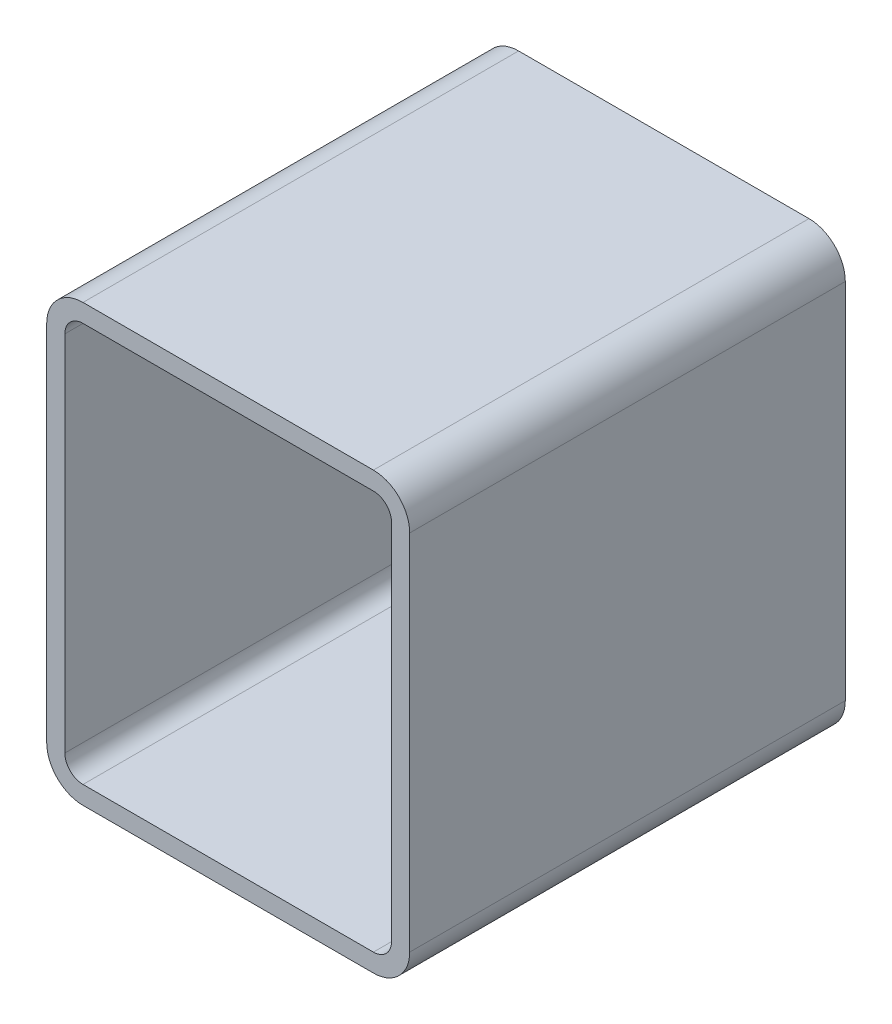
ISO-10303-21;
HEADER;
FILE_DESCRIPTION(('STEP AP214'),'2;1');
FILE_NAME('part.step','',(''),(''),'','','');
FILE_SCHEMA(('AUTOMOTIVE_DESIGN { 1 0 10303 214 1 1 1 1 }'));
ENDSEC;
DATA;
#1=APPLICATION_CONTEXT('core data for automotive mechanical design processes');
#2=APPLICATION_PROTOCOL_DEFINITION('international standard','automotive_design',2000,#1);
#3=PRODUCT_CONTEXT('',#1,'mechanical');
#4=PRODUCT('Part','Part','',(#3));
#5=PRODUCT_RELATED_PRODUCT_CATEGORY('part','',(#4));
#6=PRODUCT_DEFINITION_FORMATION('','',#4);
#7=PRODUCT_DEFINITION_CONTEXT('part definition',#1,'design');
#8=PRODUCT_DEFINITION('design','',#6,#7);
#9=PRODUCT_DEFINITION_SHAPE('','',#8);
#10=(LENGTH_UNIT() NAMED_UNIT(*) SI_UNIT(.MILLI.,.METRE.));
#11=(NAMED_UNIT(*) PLANE_ANGLE_UNIT() SI_UNIT($,.RADIAN.));
#12=(NAMED_UNIT(*) SI_UNIT($,.STERADIAN.) SOLID_ANGLE_UNIT());
#13=UNCERTAINTY_MEASURE_WITH_UNIT(LENGTH_MEASURE(1.E-05),#10,'distance_accuracy_value','');
#14=(GEOMETRIC_REPRESENTATION_CONTEXT(3) GLOBAL_UNCERTAINTY_ASSIGNED_CONTEXT((#13)) GLOBAL_UNIT_ASSIGNED_CONTEXT((#10,
#11,#12)) REPRESENTATION_CONTEXT('',''));
#15=CARTESIAN_POINT('',(0.,0.,0.));
#16=DIRECTION('',(0.,0.,1.));
#17=DIRECTION('',(1.,0.,0.));
#18=AXIS2_PLACEMENT_3D('',#15,#16,#17);
#19=CARTESIAN_POINT('',(28.1345794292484,281.274496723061,304.8));
#20=DIRECTION('',(0.,0.,1.));
#21=DIRECTION('',(1.,0.,0.));
#22=AXIS2_PLACEMENT_3D('',#19,#20,#21);
#23=PLANE('',#22);
#24=CARTESIAN_POINT('',(28.1345794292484,281.274496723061,304.8));
#25=DIRECTION('',(0.,0.,1.));
#26=DIRECTION('',(1.,0.,0.));
#27=AXIS2_PLACEMENT_3D('',#24,#25,#26);
#28=CIRCLE('',#27,25.4);
#29=CARTESIAN_POINT('',(28.1345794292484,306.674496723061,304.8));
#30=VERTEX_POINT('',#29);
#31=CARTESIAN_POINT('',(2.73457942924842,281.274496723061,304.8));
#32=VERTEX_POINT('',#31);
#33=EDGE_CURVE('E211',#30,#32,#28,.T.);
#34=ORIENTED_EDGE('',*,*,#33,.T.);
#35=DIRECTION('',(0.,-1.,0.));
#36=VECTOR('',#35,1.);
#37=CARTESIAN_POINT('',(2.73457942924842,27.2744967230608,304.8));
#38=LINE('',#37,#36);
#39=CARTESIAN_POINT('',(2.73457942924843,27.2744967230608,304.8));
#40=VERTEX_POINT('',#39);
#41=EDGE_CURVE('E214',#32,#40,#38,.T.);
#42=ORIENTED_EDGE('',*,*,#41,.T.);
#43=CARTESIAN_POINT('',(28.1345794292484,27.2744967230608,304.8));
#44=DIRECTION('',(0.,0.,1.));
#45=DIRECTION('',(1.,0.,0.));
#46=AXIS2_PLACEMENT_3D('',#43,#44,#45);
#47=CIRCLE('',#46,25.4);
#48=CARTESIAN_POINT('',(28.1345794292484,1.87449672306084,304.8));
#49=VERTEX_POINT('',#48);
#50=EDGE_CURVE('E217',#40,#49,#47,.T.);
#51=ORIENTED_EDGE('',*,*,#50,.T.);
#52=DIRECTION('',(1.,0.,0.));
#53=VECTOR('',#52,1.);
#54=CARTESIAN_POINT('',(231.334579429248,1.87449672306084,304.8));
#55=LINE('',#54,#53);
#56=CARTESIAN_POINT('',(231.334579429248,1.87449672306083,304.8));
#57=VERTEX_POINT('',#56);
#58=EDGE_CURVE('E219',#49,#57,#55,.T.);
#59=ORIENTED_EDGE('',*,*,#58,.T.);
#60=CARTESIAN_POINT('',(231.334579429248,27.2744967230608,304.8));
#61=DIRECTION('',(0.,0.,1.));
#62=DIRECTION('',(1.,0.,0.));
#63=AXIS2_PLACEMENT_3D('',#60,#61,#62);
#64=CIRCLE('',#63,25.4);
#65=CARTESIAN_POINT('',(256.734579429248,27.2744967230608,304.8));
#66=VERTEX_POINT('',#65);
#67=EDGE_CURVE('E221',#57,#66,#64,.T.);
#68=ORIENTED_EDGE('',*,*,#67,.T.);
#69=DIRECTION('',(0.,1.,0.));
#70=VECTOR('',#69,1.);
#71=CARTESIAN_POINT('',(256.734579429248,281.274496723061,304.8));
#72=LINE('',#71,#70);
#73=CARTESIAN_POINT('',(256.734579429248,281.274496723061,304.8));
#74=VERTEX_POINT('',#73);
#75=EDGE_CURVE('E223',#66,#74,#72,.T.);
#76=ORIENTED_EDGE('',*,*,#75,.T.);
#77=CARTESIAN_POINT('',(231.334579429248,281.274496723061,304.8));
#78=DIRECTION('',(0.,0.,1.));
#79=DIRECTION('',(1.,0.,0.));
#80=AXIS2_PLACEMENT_3D('',#77,#78,#79);
#81=CIRCLE('',#80,25.4);
#82=CARTESIAN_POINT('',(231.334579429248,306.674496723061,304.8));
#83=VERTEX_POINT('',#82);
#84=EDGE_CURVE('E225',#74,#83,#81,.T.);
#85=ORIENTED_EDGE('',*,*,#84,.T.);
#86=DIRECTION('',(-1.,0.,0.));
#87=VECTOR('',#86,1.);
#88=CARTESIAN_POINT('',(28.1345794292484,306.674496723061,304.8));
#89=LINE('',#88,#87);
#90=EDGE_CURVE('E227',#83,#30,#89,.T.);
#91=ORIENTED_EDGE('',*,*,#90,.T.);
#92=EDGE_LOOP('',(#34,#42,#51,#59,#68,#76,#85,#91));
#93=FACE_BOUND('',#92,.T.);
#94=DIRECTION('',(0.,-1.,0.));
#95=VECTOR('',#94,1.);
#96=CARTESIAN_POINT('',(15.4345794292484,27.2744967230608,304.8));
#97=LINE('',#96,#95);
#98=CARTESIAN_POINT('',(15.4345794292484,281.274496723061,304.8));
#99=VERTEX_POINT('',#98);
#100=CARTESIAN_POINT('',(15.4345794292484,27.2744967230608,304.8));
#101=VERTEX_POINT('',#100);
#102=EDGE_CURVE('E154',#99,#101,#97,.T.);
#103=ORIENTED_EDGE('',*,*,#102,.F.);
#104=CARTESIAN_POINT('',(28.1345794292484,281.274496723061,304.8));
#105=DIRECTION('',(0.,0.,1.));
#106=DIRECTION('',(1.,0.,0.));
#107=AXIS2_PLACEMENT_3D('',#104,#105,#106);
#108=CIRCLE('',#107,12.7);
#109=CARTESIAN_POINT('',(28.1345794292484,293.974496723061,304.8));
#110=VERTEX_POINT('',#109);
#111=EDGE_CURVE('E146',#110,#99,#108,.T.);
#112=ORIENTED_EDGE('',*,*,#111,.F.);
#113=DIRECTION('',(-1.,0.,0.));
#114=VECTOR('',#113,1.);
#115=CARTESIAN_POINT('',(28.1345794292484,293.974496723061,304.8));
#116=LINE('',#115,#114);
#117=CARTESIAN_POINT('',(231.334579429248,293.974496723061,304.8));
#118=VERTEX_POINT('',#117);
#119=EDGE_CURVE('E179',#118,#110,#116,.T.);
#120=ORIENTED_EDGE('',*,*,#119,.F.);
#121=CARTESIAN_POINT('',(231.334579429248,281.274496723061,304.8));
#122=DIRECTION('',(0.,0.,1.));
#123=DIRECTION('',(1.,0.,0.));
#124=AXIS2_PLACEMENT_3D('',#121,#122,#123);
#125=CIRCLE('',#124,12.7);
#126=CARTESIAN_POINT('',(244.034579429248,281.274496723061,304.8));
#127=VERTEX_POINT('',#126);
#128=EDGE_CURVE('E177',#127,#118,#125,.T.);
#129=ORIENTED_EDGE('',*,*,#128,.F.);
#130=DIRECTION('',(0.,1.,0.));
#131=VECTOR('',#130,1.);
#132=CARTESIAN_POINT('',(244.034579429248,281.274496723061,304.8));
#133=LINE('',#132,#131);
#134=CARTESIAN_POINT('',(244.034579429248,27.2744967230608,304.8));
#135=VERTEX_POINT('',#134);
#136=EDGE_CURVE('E175',#135,#127,#133,.T.);
#137=ORIENTED_EDGE('',*,*,#136,.F.);
#138=CARTESIAN_POINT('',(231.334579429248,27.2744967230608,304.8));
#139=DIRECTION('',(0.,0.,1.));
#140=DIRECTION('',(1.,0.,0.));
#141=AXIS2_PLACEMENT_3D('',#138,#139,#140);
#142=CIRCLE('',#141,12.7);
#143=CARTESIAN_POINT('',(231.334579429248,14.5744967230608,304.8));
#144=VERTEX_POINT('',#143);
#145=EDGE_CURVE('E173',#144,#135,#142,.T.);
#146=ORIENTED_EDGE('',*,*,#145,.F.);
#147=DIRECTION('',(1.,0.,0.));
#148=VECTOR('',#147,1.);
#149=CARTESIAN_POINT('',(231.334579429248,14.5744967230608,304.8));
#150=LINE('',#149,#148);
#151=CARTESIAN_POINT('',(28.1345794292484,14.5744967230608,304.8));
#152=VERTEX_POINT('',#151);
#153=EDGE_CURVE('E169',#152,#144,#150,.T.);
#154=ORIENTED_EDGE('',*,*,#153,.F.);
#155=CARTESIAN_POINT('',(28.1345794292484,27.2744967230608,304.8));
#156=DIRECTION('',(0.,0.,1.));
#157=DIRECTION('',(1.,0.,0.));
#158=AXIS2_PLACEMENT_3D('',#155,#156,#157);
#159=CIRCLE('',#158,12.7);
#160=EDGE_CURVE('E167',#101,#152,#159,.T.);
#161=ORIENTED_EDGE('',*,*,#160,.F.);
#162=EDGE_LOOP('',(#103,#112,#120,#129,#137,#146,#154,#161));
#163=FACE_BOUND('',#162,.T.);
#164=ADVANCED_FACE('F33',(#93,#163),#23,.T.);
#165=CARTESIAN_POINT('',(28.1345794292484,281.274496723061,0.));
#166=DIRECTION('',(0.,0.,1.));
#167=DIRECTION('',(1.,0.,0.));
#168=AXIS2_PLACEMENT_3D('',#165,#166,#167);
#169=PLANE('',#168);
#170=CARTESIAN_POINT('',(28.1345794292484,281.274496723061,0.));
#171=DIRECTION('',(0.,0.,1.));
#172=DIRECTION('',(1.,0.,0.));
#173=AXIS2_PLACEMENT_3D('',#170,#171,#172);
#174=CIRCLE('',#173,25.4);
#175=CARTESIAN_POINT('',(28.1345794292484,306.674496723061,0.));
#176=VERTEX_POINT('',#175);
#177=CARTESIAN_POINT('',(2.73457942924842,281.274496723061,0.));
#178=VERTEX_POINT('',#177);
#179=EDGE_CURVE('E162',#176,#178,#174,.T.);
#180=ORIENTED_EDGE('',*,*,#179,.F.);
#181=DIRECTION('',(-1.,0.,0.));
#182=VECTOR('',#181,1.);
#183=CARTESIAN_POINT('',(28.1345794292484,306.674496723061,0.));
#184=LINE('',#183,#182);
#185=CARTESIAN_POINT('',(231.334579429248,306.674496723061,0.));
#186=VERTEX_POINT('',#185);
#187=EDGE_CURVE('E215',#186,#176,#184,.T.);
#188=ORIENTED_EDGE('',*,*,#187,.F.);
#189=CARTESIAN_POINT('',(231.334579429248,281.274496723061,0.));
#190=DIRECTION('',(0.,0.,1.));
#191=DIRECTION('',(1.,0.,0.));
#192=AXIS2_PLACEMENT_3D('',#189,#190,#191);
#193=CIRCLE('',#192,25.4);
#194=CARTESIAN_POINT('',(256.734579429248,281.274496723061,0.));
#195=VERTEX_POINT('',#194);
#196=EDGE_CURVE('E242',#195,#186,#193,.T.);
#197=ORIENTED_EDGE('',*,*,#196,.F.);
#198=DIRECTION('',(0.,1.,0.));
#199=VECTOR('',#198,1.);
#200=CARTESIAN_POINT('',(256.734579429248,281.274496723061,0.));
#201=LINE('',#200,#199);
#202=CARTESIAN_POINT('',(256.734579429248,27.2744967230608,0.));
#203=VERTEX_POINT('',#202);
#204=EDGE_CURVE('E240',#203,#195,#201,.T.);
#205=ORIENTED_EDGE('',*,*,#204,.F.);
#206=CARTESIAN_POINT('',(231.334579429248,27.2744967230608,0.));
#207=DIRECTION('',(0.,0.,1.));
#208=DIRECTION('',(1.,0.,0.));
#209=AXIS2_PLACEMENT_3D('',#206,#207,#208);
#210=CIRCLE('',#209,25.4);
#211=CARTESIAN_POINT('',(231.334579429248,1.87449672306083,0.));
#212=VERTEX_POINT('',#211);
#213=EDGE_CURVE('E238',#212,#203,#210,.T.);
#214=ORIENTED_EDGE('',*,*,#213,.F.);
#215=DIRECTION('',(1.,0.,0.));
#216=VECTOR('',#215,1.);
#217=CARTESIAN_POINT('',(231.334579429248,1.87449672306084,0.));
#218=LINE('',#217,#216);
#219=CARTESIAN_POINT('',(28.1345794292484,1.87449672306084,0.));
#220=VERTEX_POINT('',#219);
#221=EDGE_CURVE('E236',#220,#212,#218,.T.);
#222=ORIENTED_EDGE('',*,*,#221,.F.);
#223=CARTESIAN_POINT('',(28.1345794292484,27.2744967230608,0.));
#224=DIRECTION('',(0.,0.,1.));
#225=DIRECTION('',(1.,0.,0.));
#226=AXIS2_PLACEMENT_3D('',#223,#224,#225);
#227=CIRCLE('',#226,25.4);
#228=CARTESIAN_POINT('',(2.73457942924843,27.2744967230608,0.));
#229=VERTEX_POINT('',#228);
#230=EDGE_CURVE('E234',#229,#220,#227,.T.);
#231=ORIENTED_EDGE('',*,*,#230,.F.);
#232=DIRECTION('',(0.,-1.,0.));
#233=VECTOR('',#232,1.);
#234=CARTESIAN_POINT('',(2.73457942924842,27.2744967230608,0.));
#235=LINE('',#234,#233);
#236=EDGE_CURVE('E232',#178,#229,#235,.T.);
#237=ORIENTED_EDGE('',*,*,#236,.F.);
#238=EDGE_LOOP('',(#180,#188,#197,#205,#214,#222,#231,#237));
#239=FACE_BOUND('',#238,.T.);
#240=CARTESIAN_POINT('',(28.1345794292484,281.274496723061,0.));
#241=DIRECTION('',(0.,0.,1.));
#242=DIRECTION('',(1.,0.,0.));
#243=AXIS2_PLACEMENT_3D('',#240,#241,#242);
#244=CIRCLE('',#243,12.7);
#245=CARTESIAN_POINT('',(28.1345794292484,293.974496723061,0.));
#246=VERTEX_POINT('',#245);
#247=CARTESIAN_POINT('',(15.4345794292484,281.274496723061,0.));
#248=VERTEX_POINT('',#247);
#249=EDGE_CURVE('E56',#246,#248,#244,.T.);
#250=ORIENTED_EDGE('',*,*,#249,.T.);
#251=DIRECTION('',(0.,-1.,0.));
#252=VECTOR('',#251,1.);
#253=CARTESIAN_POINT('',(15.4345794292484,27.2744967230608,0.));
#254=LINE('',#253,#252);
#255=CARTESIAN_POINT('',(15.4345794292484,27.2744967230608,0.));
#256=VERTEX_POINT('',#255);
#257=EDGE_CURVE('E161',#248,#256,#254,.T.);
#258=ORIENTED_EDGE('',*,*,#257,.T.);
#259=CARTESIAN_POINT('',(28.1345794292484,27.2744967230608,0.));
#260=DIRECTION('',(0.,0.,1.));
#261=DIRECTION('',(1.,0.,0.));
#262=AXIS2_PLACEMENT_3D('',#259,#260,#261);
#263=CIRCLE('',#262,12.7);
#264=CARTESIAN_POINT('',(28.1345794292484,14.5744967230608,0.));
#265=VERTEX_POINT('',#264);
#266=EDGE_CURVE('E183',#256,#265,#263,.T.);
#267=ORIENTED_EDGE('',*,*,#266,.T.);
#268=DIRECTION('',(1.,0.,0.));
#269=VECTOR('',#268,1.);
#270=CARTESIAN_POINT('',(231.334579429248,14.5744967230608,0.));
#271=LINE('',#270,#269);
#272=CARTESIAN_POINT('',(231.334579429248,14.5744967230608,0.));
#273=VERTEX_POINT('',#272);
#274=EDGE_CURVE('E186',#265,#273,#271,.T.);
#275=ORIENTED_EDGE('',*,*,#274,.T.);
#276=CARTESIAN_POINT('',(231.334579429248,27.2744967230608,0.));
#277=DIRECTION('',(0.,0.,1.));
#278=DIRECTION('',(1.,0.,0.));
#279=AXIS2_PLACEMENT_3D('',#276,#277,#278);
#280=CIRCLE('',#279,12.7);
#281=CARTESIAN_POINT('',(244.034579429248,27.2744967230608,0.));
#282=VERTEX_POINT('',#281);
#283=EDGE_CURVE('E189',#273,#282,#280,.T.);
#284=ORIENTED_EDGE('',*,*,#283,.T.);
#285=DIRECTION('',(0.,1.,0.));
#286=VECTOR('',#285,1.);
#287=CARTESIAN_POINT('',(244.034579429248,281.274496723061,0.));
#288=LINE('',#287,#286);
#289=CARTESIAN_POINT('',(244.034579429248,281.274496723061,0.));
#290=VERTEX_POINT('',#289);
#291=EDGE_CURVE('E192',#282,#290,#288,.T.);
#292=ORIENTED_EDGE('',*,*,#291,.T.);
#293=CARTESIAN_POINT('',(231.334579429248,281.274496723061,0.));
#294=DIRECTION('',(0.,0.,1.));
#295=DIRECTION('',(1.,0.,0.));
#296=AXIS2_PLACEMENT_3D('',#293,#294,#295);
#297=CIRCLE('',#296,12.7);
#298=CARTESIAN_POINT('',(231.334579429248,293.974496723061,0.));
#299=VERTEX_POINT('',#298);
#300=EDGE_CURVE('E195',#290,#299,#297,.T.);
#301=ORIENTED_EDGE('',*,*,#300,.T.);
#302=DIRECTION('',(-1.,0.,0.));
#303=VECTOR('',#302,1.);
#304=CARTESIAN_POINT('',(28.1345794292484,293.974496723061,0.));
#305=LINE('',#304,#303);
#306=EDGE_CURVE('E155',#299,#246,#305,.T.);
#307=ORIENTED_EDGE('',*,*,#306,.T.);
#308=EDGE_LOOP('',(#250,#258,#267,#275,#284,#292,#301,#307));
#309=FACE_BOUND('',#308,.T.);
#310=ADVANCED_FACE('F272',(#239,#309),#169,.F.);
#311=CARTESIAN_POINT('',(28.1345794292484,281.274496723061,304.8));
#312=DIRECTION('',(0.,0.,-1.));
#313=DIRECTION('',(-1.,0.,0.));
#314=AXIS2_PLACEMENT_3D('',#311,#312,#313);
#315=CYLINDRICAL_SURFACE('',#314,25.4);
#316=ORIENTED_EDGE('',*,*,#179,.T.);
#317=DIRECTION('',(0.,0.,-1.));
#318=VECTOR('',#317,1.);
#319=CARTESIAN_POINT('',(2.73457942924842,281.274496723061,304.8));
#320=LINE('',#319,#318);
#321=EDGE_CURVE('E11',#32,#178,#320,.T.);
#322=ORIENTED_EDGE('',*,*,#321,.F.);
#323=ORIENTED_EDGE('',*,*,#33,.F.);
#324=DIRECTION('',(0.,0.,-1.));
#325=VECTOR('',#324,1.);
#326=CARTESIAN_POINT('',(28.1345794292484,306.674496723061,304.8));
#327=LINE('',#326,#325);
#328=EDGE_CURVE('E229',#30,#176,#327,.T.);
#329=ORIENTED_EDGE('',*,*,#328,.T.);
#330=EDGE_LOOP('',(#316,#322,#323,#329));
#331=FACE_BOUND('',#330,.T.);
#332=ADVANCED_FACE('F35',(#331),#315,.T.);
#333=CARTESIAN_POINT('',(2.73457942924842,27.2744967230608,304.8));
#334=DIRECTION('',(1.,0.,0.));
#335=DIRECTION('',(0.,0.,-1.));
#336=AXIS2_PLACEMENT_3D('',#333,#334,#335);
#337=PLANE('',#336);
#338=ORIENTED_EDGE('',*,*,#236,.T.);
#339=DIRECTION('',(0.,0.,-1.));
#340=VECTOR('',#339,1.);
#341=CARTESIAN_POINT('',(2.73457942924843,27.2744967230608,304.8));
#342=LINE('',#341,#340);
#343=EDGE_CURVE('E41',#40,#229,#342,.T.);
#344=ORIENTED_EDGE('',*,*,#343,.F.);
#345=ORIENTED_EDGE('',*,*,#41,.F.);
#346=ORIENTED_EDGE('',*,*,#321,.T.);
#347=EDGE_LOOP('',(#338,#344,#345,#346));
#348=FACE_BOUND('',#347,.T.);
#349=ADVANCED_FACE('F289',(#348),#337,.F.);
#350=CARTESIAN_POINT('',(28.1345794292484,27.2744967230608,304.8));
#351=DIRECTION('',(0.,0.,-1.));
#352=DIRECTION('',(-1.,0.,0.));
#353=AXIS2_PLACEMENT_3D('',#350,#351,#352);
#354=CYLINDRICAL_SURFACE('',#353,25.4);
#355=ORIENTED_EDGE('',*,*,#230,.T.);
#356=DIRECTION('',(0.,0.,-1.));
#357=VECTOR('',#356,1.);
#358=CARTESIAN_POINT('',(28.1345794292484,1.87449672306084,304.8));
#359=LINE('',#358,#357);
#360=EDGE_CURVE('E259',#49,#220,#359,.T.);
#361=ORIENTED_EDGE('',*,*,#360,.F.);
#362=ORIENTED_EDGE('',*,*,#50,.F.);
#363=ORIENTED_EDGE('',*,*,#343,.T.);
#364=EDGE_LOOP('',(#355,#361,#362,#363));
#365=FACE_BOUND('',#364,.T.);
#366=ADVANCED_FACE('F266',(#365),#354,.T.);
#367=CARTESIAN_POINT('',(231.334579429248,1.87449672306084,304.8));
#368=DIRECTION('',(0.,1.,0.));
#369=DIRECTION('',(0.,0.,1.));
#370=AXIS2_PLACEMENT_3D('',#367,#368,#369);
#371=PLANE('',#370);
#372=ORIENTED_EDGE('',*,*,#221,.T.);
#373=DIRECTION('',(0.,0.,-1.));
#374=VECTOR('',#373,1.);
#375=CARTESIAN_POINT('',(231.334579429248,1.87449672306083,304.8));
#376=LINE('',#375,#374);
#377=EDGE_CURVE('E256',#57,#212,#376,.T.);
#378=ORIENTED_EDGE('',*,*,#377,.F.);
#379=ORIENTED_EDGE('',*,*,#58,.F.);
#380=ORIENTED_EDGE('',*,*,#360,.T.);
#381=EDGE_LOOP('',(#372,#378,#379,#380));
#382=FACE_BOUND('',#381,.T.);
#383=ADVANCED_FACE('F278',(#382),#371,.F.);
#384=CARTESIAN_POINT('',(231.334579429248,27.2744967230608,304.8));
#385=DIRECTION('',(0.,0.,-1.));
#386=DIRECTION('',(-1.,0.,0.));
#387=AXIS2_PLACEMENT_3D('',#384,#385,#386);
#388=CYLINDRICAL_SURFACE('',#387,25.4);
#389=ORIENTED_EDGE('',*,*,#213,.T.);
#390=DIRECTION('',(0.,0.,-1.));
#391=VECTOR('',#390,1.);
#392=CARTESIAN_POINT('',(256.734579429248,27.2744967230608,304.8));
#393=LINE('',#392,#391);
#394=EDGE_CURVE('E253',#66,#203,#393,.T.);
#395=ORIENTED_EDGE('',*,*,#394,.F.);
#396=ORIENTED_EDGE('',*,*,#67,.F.);
#397=ORIENTED_EDGE('',*,*,#377,.T.);
#398=EDGE_LOOP('',(#389,#395,#396,#397));
#399=FACE_BOUND('',#398,.T.);
#400=ADVANCED_FACE('F282',(#399),#388,.T.);
#401=CARTESIAN_POINT('',(256.734579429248,281.274496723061,304.8));
#402=DIRECTION('',(-1.,0.,0.));
#403=DIRECTION('',(0.,0.,1.));
#404=AXIS2_PLACEMENT_3D('',#401,#402,#403);
#405=PLANE('',#404);
#406=ORIENTED_EDGE('',*,*,#204,.T.);
#407=DIRECTION('',(0.,0.,-1.));
#408=VECTOR('',#407,1.);
#409=CARTESIAN_POINT('',(256.734579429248,281.274496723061,304.8));
#410=LINE('',#409,#408);
#411=EDGE_CURVE('E250',#74,#195,#410,.T.);
#412=ORIENTED_EDGE('',*,*,#411,.F.);
#413=ORIENTED_EDGE('',*,*,#75,.F.);
#414=ORIENTED_EDGE('',*,*,#394,.T.);
#415=EDGE_LOOP('',(#406,#412,#413,#414));
#416=FACE_BOUND('',#415,.T.);
#417=ADVANCED_FACE('F302',(#416),#405,.F.);
#418=CARTESIAN_POINT('',(231.334579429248,281.274496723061,304.8));
#419=DIRECTION('',(0.,0.,-1.));
#420=DIRECTION('',(-1.,0.,0.));
#421=AXIS2_PLACEMENT_3D('',#418,#419,#420);
#422=CYLINDRICAL_SURFACE('',#421,25.4);
#423=ORIENTED_EDGE('',*,*,#196,.T.);
#424=DIRECTION('',(0.,0.,-1.));
#425=VECTOR('',#424,1.);
#426=CARTESIAN_POINT('',(231.334579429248,306.674496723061,304.8));
#427=LINE('',#426,#425);
#428=EDGE_CURVE('E247',#83,#186,#427,.T.);
#429=ORIENTED_EDGE('',*,*,#428,.F.);
#430=ORIENTED_EDGE('',*,*,#84,.F.);
#431=ORIENTED_EDGE('',*,*,#411,.T.);
#432=EDGE_LOOP('',(#423,#429,#430,#431));
#433=FACE_BOUND('',#432,.T.);
#434=ADVANCED_FACE('F300',(#433),#422,.T.);
#435=CARTESIAN_POINT('',(28.1345794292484,306.674496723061,304.8));
#436=DIRECTION('',(0.,-1.,0.));
#437=DIRECTION('',(0.,0.,-1.));
#438=AXIS2_PLACEMENT_3D('',#435,#436,#437);
#439=PLANE('',#438);
#440=ORIENTED_EDGE('',*,*,#187,.T.);
#441=ORIENTED_EDGE('',*,*,#328,.F.);
#442=ORIENTED_EDGE('',*,*,#90,.F.);
#443=ORIENTED_EDGE('',*,*,#428,.T.);
#444=EDGE_LOOP('',(#440,#441,#442,#443));
#445=FACE_BOUND('',#444,.T.);
#446=ADVANCED_FACE('F295',(#445),#439,.F.);
#447=CARTESIAN_POINT('',(28.1345794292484,281.274496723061,304.8));
#448=DIRECTION('',(0.,0.,-1.));
#449=DIRECTION('',(-1.,0.,0.));
#450=AXIS2_PLACEMENT_3D('',#447,#448,#449);
#451=CYLINDRICAL_SURFACE('',#450,12.7);
#452=ORIENTED_EDGE('',*,*,#249,.F.);
#453=DIRECTION('',(0.,0.,-1.));
#454=VECTOR('',#453,1.);
#455=CARTESIAN_POINT('',(28.1345794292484,293.974496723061,304.8));
#456=LINE('',#455,#454);
#457=EDGE_CURVE('E150',#110,#246,#456,.T.);
#458=ORIENTED_EDGE('',*,*,#457,.F.);
#459=ORIENTED_EDGE('',*,*,#111,.T.);
#460=DIRECTION('',(0.,0.,-1.));
#461=VECTOR('',#460,1.);
#462=CARTESIAN_POINT('',(15.4345794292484,281.274496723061,304.8));
#463=LINE('',#462,#461);
#464=EDGE_CURVE('E149',#99,#248,#463,.T.);
#465=ORIENTED_EDGE('',*,*,#464,.T.);
#466=EDGE_LOOP('',(#452,#458,#459,#465));
#467=FACE_BOUND('',#466,.T.);
#468=ADVANCED_FACE('F148',(#467),#451,.F.);
#469=CARTESIAN_POINT('',(15.4345794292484,27.2744967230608,304.8));
#470=DIRECTION('',(1.,0.,0.));
#471=DIRECTION('',(0.,0.,-1.));
#472=AXIS2_PLACEMENT_3D('',#469,#470,#471);
#473=PLANE('',#472);
#474=ORIENTED_EDGE('',*,*,#257,.F.);
#475=ORIENTED_EDGE('',*,*,#464,.F.);
#476=ORIENTED_EDGE('',*,*,#102,.T.);
#477=DIRECTION('',(0.,0.,-1.));
#478=VECTOR('',#477,1.);
#479=CARTESIAN_POINT('',(15.4345794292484,27.2744967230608,304.8));
#480=LINE('',#479,#478);
#481=EDGE_CURVE('E163',#101,#256,#480,.T.);
#482=ORIENTED_EDGE('',*,*,#481,.T.);
#483=EDGE_LOOP('',(#474,#475,#476,#482));
#484=FACE_BOUND('',#483,.T.);
#485=ADVANCED_FACE('F158',(#484),#473,.T.);
#486=CARTESIAN_POINT('',(28.1345794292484,27.2744967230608,304.8));
#487=DIRECTION('',(0.,0.,-1.));
#488=DIRECTION('',(-1.,0.,0.));
#489=AXIS2_PLACEMENT_3D('',#486,#487,#488);
#490=CYLINDRICAL_SURFACE('',#489,12.7);
#491=ORIENTED_EDGE('',*,*,#266,.F.);
#492=ORIENTED_EDGE('',*,*,#481,.F.);
#493=ORIENTED_EDGE('',*,*,#160,.T.);
#494=DIRECTION('',(0.,0.,-1.));
#495=VECTOR('',#494,1.);
#496=CARTESIAN_POINT('',(28.1345794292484,14.5744967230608,304.8));
#497=LINE('',#496,#495);
#498=EDGE_CURVE('E208',#152,#265,#497,.T.);
#499=ORIENTED_EDGE('',*,*,#498,.T.);
#500=EDGE_LOOP('',(#491,#492,#493,#499));
#501=FACE_BOUND('',#500,.T.);
#502=ADVANCED_FACE('F327',(#501),#490,.F.);
#503=CARTESIAN_POINT('',(231.334579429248,14.5744967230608,304.8));
#504=DIRECTION('',(0.,1.,0.));
#505=DIRECTION('',(0.,0.,1.));
#506=AXIS2_PLACEMENT_3D('',#503,#504,#505);
#507=PLANE('',#506);
#508=ORIENTED_EDGE('',*,*,#274,.F.);
#509=ORIENTED_EDGE('',*,*,#498,.F.);
#510=ORIENTED_EDGE('',*,*,#153,.T.);
#511=DIRECTION('',(0.,0.,-1.));
#512=VECTOR('',#511,1.);
#513=CARTESIAN_POINT('',(231.334579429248,14.5744967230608,304.8));
#514=LINE('',#513,#512);
#515=EDGE_CURVE('E206',#144,#273,#514,.T.);
#516=ORIENTED_EDGE('',*,*,#515,.T.);
#517=EDGE_LOOP('',(#508,#509,#510,#516));
#518=FACE_BOUND('',#517,.T.);
#519=ADVANCED_FACE('F331',(#518),#507,.T.);
#520=CARTESIAN_POINT('',(231.334579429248,27.2744967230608,304.8));
#521=DIRECTION('',(0.,0.,-1.));
#522=DIRECTION('',(-1.,0.,0.));
#523=AXIS2_PLACEMENT_3D('',#520,#521,#522);
#524=CYLINDRICAL_SURFACE('',#523,12.7);
#525=ORIENTED_EDGE('',*,*,#283,.F.);
#526=ORIENTED_EDGE('',*,*,#515,.F.);
#527=ORIENTED_EDGE('',*,*,#145,.T.);
#528=DIRECTION('',(0.,0.,-1.));
#529=VECTOR('',#528,1.);
#530=CARTESIAN_POINT('',(244.034579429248,27.2744967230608,304.8));
#531=LINE('',#530,#529);
#532=EDGE_CURVE('E204',#135,#282,#531,.T.);
#533=ORIENTED_EDGE('',*,*,#532,.T.);
#534=EDGE_LOOP('',(#525,#526,#527,#533));
#535=FACE_BOUND('',#534,.T.);
#536=ADVANCED_FACE('F337',(#535),#524,.F.);
#537=CARTESIAN_POINT('',(244.034579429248,281.274496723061,304.8));
#538=DIRECTION('',(-1.,0.,0.));
#539=DIRECTION('',(0.,0.,1.));
#540=AXIS2_PLACEMENT_3D('',#537,#538,#539);
#541=PLANE('',#540);
#542=ORIENTED_EDGE('',*,*,#291,.F.);
#543=ORIENTED_EDGE('',*,*,#532,.F.);
#544=ORIENTED_EDGE('',*,*,#136,.T.);
#545=DIRECTION('',(0.,0.,-1.));
#546=VECTOR('',#545,1.);
#547=CARTESIAN_POINT('',(244.034579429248,281.274496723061,304.8));
#548=LINE('',#547,#546);
#549=EDGE_CURVE('E202',#127,#290,#548,.T.);
#550=ORIENTED_EDGE('',*,*,#549,.T.);
#551=EDGE_LOOP('',(#542,#543,#544,#550));
#552=FACE_BOUND('',#551,.T.);
#553=ADVANCED_FACE('F341',(#552),#541,.T.);
#554=CARTESIAN_POINT('',(231.334579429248,281.274496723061,304.8));
#555=DIRECTION('',(0.,0.,-1.));
#556=DIRECTION('',(-1.,0.,0.));
#557=AXIS2_PLACEMENT_3D('',#554,#555,#556);
#558=CYLINDRICAL_SURFACE('',#557,12.7);
#559=ORIENTED_EDGE('',*,*,#300,.F.);
#560=ORIENTED_EDGE('',*,*,#549,.F.);
#561=ORIENTED_EDGE('',*,*,#128,.T.);
#562=DIRECTION('',(0.,0.,-1.));
#563=VECTOR('',#562,1.);
#564=CARTESIAN_POINT('',(231.334579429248,293.974496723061,304.8));
#565=LINE('',#564,#563);
#566=EDGE_CURVE('E48',#118,#299,#565,.T.);
#567=ORIENTED_EDGE('',*,*,#566,.T.);
#568=EDGE_LOOP('',(#559,#560,#561,#567));
#569=FACE_BOUND('',#568,.T.);
#570=ADVANCED_FACE('F345',(#569),#558,.F.);
#571=CARTESIAN_POINT('',(28.1345794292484,293.974496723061,304.8));
#572=DIRECTION('',(0.,-1.,0.));
#573=DIRECTION('',(0.,0.,-1.));
#574=AXIS2_PLACEMENT_3D('',#571,#572,#573);
#575=PLANE('',#574);
#576=ORIENTED_EDGE('',*,*,#306,.F.);
#577=ORIENTED_EDGE('',*,*,#566,.F.);
#578=ORIENTED_EDGE('',*,*,#119,.T.);
#579=ORIENTED_EDGE('',*,*,#457,.T.);
#580=EDGE_LOOP('',(#576,#577,#578,#579));
#581=FACE_BOUND('',#580,.T.);
#582=ADVANCED_FACE('F349',(#581),#575,.T.);
#583=CLOSED_SHELL('',(#164,#310,#332,#349,#366,#383,#400,#417,#434,#446,#468,#485,#502,#519,
#536,#553,#570,#582));
#584=MANIFOLD_SOLID_BREP('B2',#583);
#585=ADVANCED_BREP_SHAPE_REPRESENTATION('',(#18,#584),#14);
#586=SHAPE_DEFINITION_REPRESENTATION(#9,#585);
ENDSEC;
END-ISO-10303-21;
